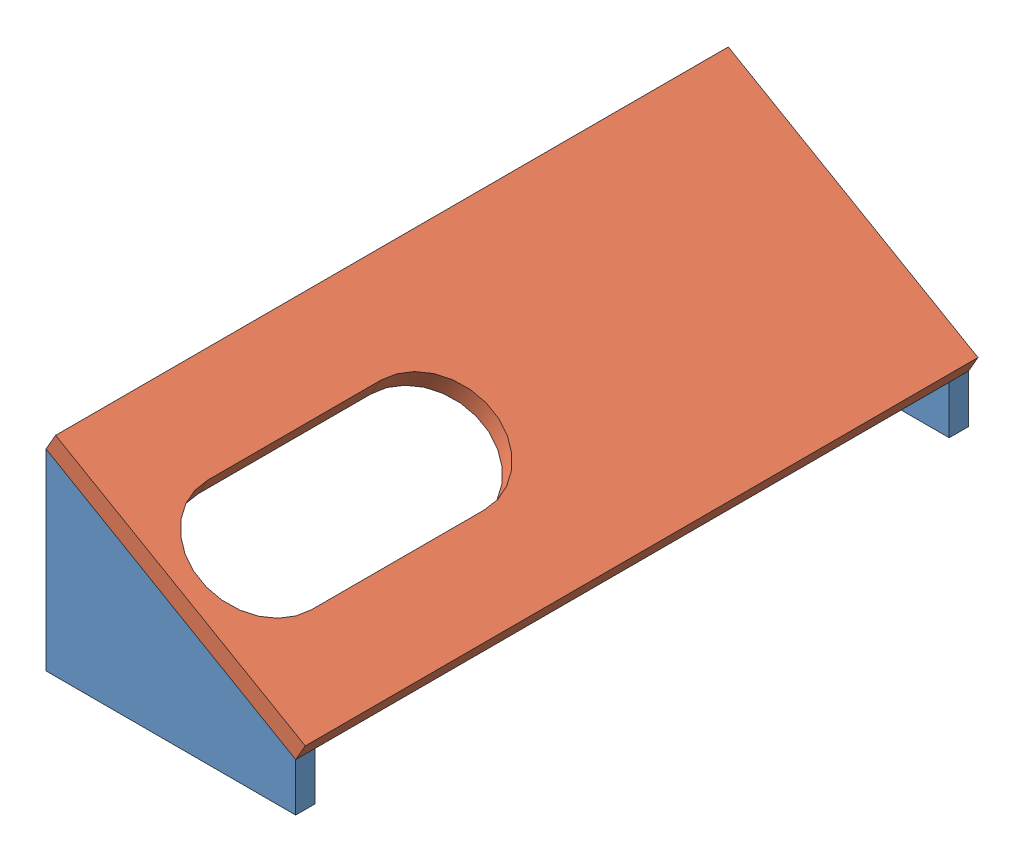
SolidWorks assembly Baugruppe1.SLDASM, configuration Standard (file format 5000). Lengths in mm.
Overall size (269.81 217.32 700).
3 component instances, 2 part files, 6 mates.
Components (placement in the parent):
- Seitenteil-1: Seitenteil.SLDPRT [Standard] at (6.8241 -88.498 -10) size (259.81 200 20)
- Seitenteil-2: Seitenteil.SLDPRT [Standard] at (6.8241 -88.498 -690) size (259.81 200 20)
- Platte1-2: Platte1.SLDPRT [Standard] at (-123.0797 36.502 -340) x (0 0 -1) z (0.5 0.866025 0) size (700 300 20)
Mates (geometry in assembly coordinates):
- Deckungsgleich9: coincident anti-aligned: line of Seitenteil-1 through (6.8241 -38.498 10) axis (-0.866025 0.5 0); line of Platte1-2 through (-252.9835 111.502 10) axis (0.866025 -0.5 0)
- Deckungsgleich10: coincident: line of Seitenteil-2 through (6.8241 -38.498 -690) axis (-0.866025 0.5 0); line of Platte1-2 through (6.8241 -38.498 -690) axis (-0.866025 0.5 0)
- Deckungsgleich11: coincident: plane of Seitenteil-2 through (-252.9835 111.502 -670) normal (0.5 0.866025 0); plane of Platte1-2 through (-123.0797 36.502 -340) normal (-0.5 -0.866025 0)
- Deckungsgleich12: coincident anti-aligned: plane of Seitenteil-1 through (-252.9835 111.502 10) normal (0.5 0.866025 0); plane of Platte1-2 through (-123.0797 36.502 -340) normal (-0.5 -0.866025 0)
- Deckungsgleich13: coincident aligned: line of Seitenteil-1 through (6.8241 -38.498 10) axis (0 0 -1); line of Platte1-2 through (6.8241 -38.498 10) axis (0 0 -1)
- Deckungsgleich14: coincident aligned: line of Seitenteil-2 through (6.8241 -38.498 -670) axis (0 0 -1); line of Platte1-2 through (6.8241 -38.498 10) axis (0 0 -1)
